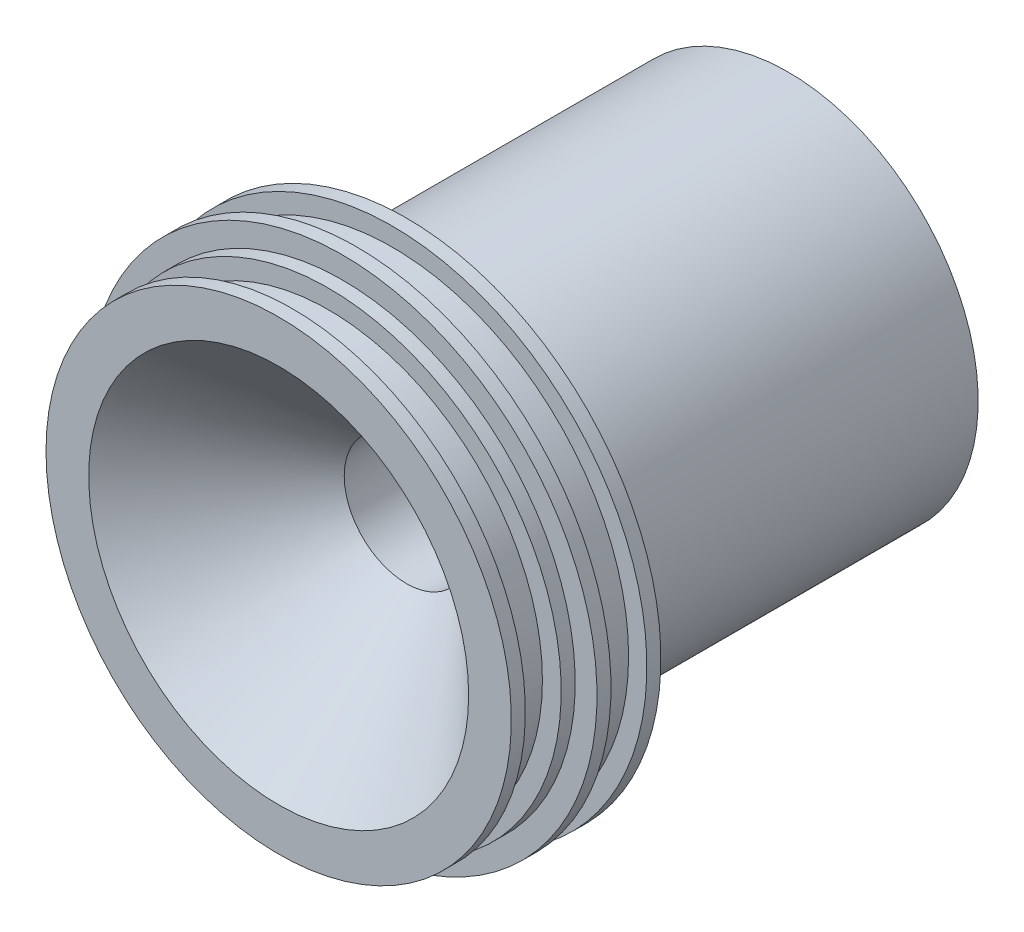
ISO-10303-21;
HEADER;
FILE_DESCRIPTION(('STEP AP214'),'2;1');
FILE_NAME('part.step','',(''),(''),'','','');
FILE_SCHEMA(('AUTOMOTIVE_DESIGN { 1 0 10303 214 1 1 1 1 }'));
ENDSEC;
DATA;
#1=APPLICATION_CONTEXT('core data for automotive mechanical design processes');
#2=APPLICATION_PROTOCOL_DEFINITION('international standard','automotive_design',2000,#1);
#3=PRODUCT_CONTEXT('',#1,'mechanical');
#4=PRODUCT('Part','Part','',(#3));
#5=PRODUCT_RELATED_PRODUCT_CATEGORY('part','',(#4));
#6=PRODUCT_DEFINITION_FORMATION('','',#4);
#7=PRODUCT_DEFINITION_CONTEXT('part definition',#1,'design');
#8=PRODUCT_DEFINITION('design','',#6,#7);
#9=PRODUCT_DEFINITION_SHAPE('','',#8);
#10=(LENGTH_UNIT() NAMED_UNIT(*) SI_UNIT(.MILLI.,.METRE.));
#11=(NAMED_UNIT(*) PLANE_ANGLE_UNIT() SI_UNIT($,.RADIAN.));
#12=(NAMED_UNIT(*) SI_UNIT($,.STERADIAN.) SOLID_ANGLE_UNIT());
#13=UNCERTAINTY_MEASURE_WITH_UNIT(LENGTH_MEASURE(1.E-05),#10,'distance_accuracy_value','');
#14=(GEOMETRIC_REPRESENTATION_CONTEXT(3) GLOBAL_UNCERTAINTY_ASSIGNED_CONTEXT((#13)) GLOBAL_UNIT_ASSIGNED_CONTEXT((#10,
#11,#12)) REPRESENTATION_CONTEXT('',''));
#15=CARTESIAN_POINT('',(0.,0.,0.));
#16=DIRECTION('',(0.,0.,1.));
#17=DIRECTION('',(1.,0.,0.));
#18=AXIS2_PLACEMENT_3D('',#15,#16,#17);
#19=CARTESIAN_POINT('',(0.,0.,-87.4649220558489));
#20=DIRECTION('',(0.,0.,-1.));
#21=DIRECTION('',(-1.,0.,0.));
#22=AXIS2_PLACEMENT_3D('',#19,#20,#21);
#23=CYLINDRICAL_SURFACE('',#22,37.846);
#24=CARTESIAN_POINT('',(0.,0.,16.7689530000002));
#25=DIRECTION('',(0.,0.,-1.));
#26=DIRECTION('',(-1.,0.,0.));
#27=AXIS2_PLACEMENT_3D('',#24,#25,#26);
#28=CIRCLE('',#27,37.846);
#29=CARTESIAN_POINT('',(-37.846,0.,16.7689530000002));
#30=VERTEX_POINT('',#29);
#31=EDGE_CURVE('E114',#30,#30,#28,.T.);
#32=ORIENTED_EDGE('',*,*,#31,.T.);
#33=EDGE_LOOP('',(#32));
#34=FACE_BOUND('',#33,.T.);
#35=CARTESIAN_POINT('',(0.,0.,14.6849465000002));
#36=DIRECTION('',(0.,0.,-1.));
#37=DIRECTION('',(-1.,0.,0.));
#38=AXIS2_PLACEMENT_3D('',#35,#36,#37);
#39=CIRCLE('',#38,37.846);
#40=CARTESIAN_POINT('',(-37.846,0.,14.6849465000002));
#41=VERTEX_POINT('',#40);
#42=EDGE_CURVE('E10',#41,#41,#39,.T.);
#43=ORIENTED_EDGE('',*,*,#42,.F.);
#44=EDGE_LOOP('',(#43));
#45=FACE_BOUND('',#44,.T.);
#46=ADVANCED_FACE('F37',(#34,#45),#23,.T.);
#47=CARTESIAN_POINT('',(0.,37.846,14.6849465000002));
#48=DIRECTION('',(0.,0.,-1.));
#49=DIRECTION('',(-1.,0.,0.));
#50=AXIS2_PLACEMENT_3D('',#47,#48,#49);
#51=PLANE('',#50);
#52=ORIENTED_EDGE('',*,*,#42,.T.);
#53=EDGE_LOOP('',(#52));
#54=FACE_BOUND('',#53,.T.);
#55=CARTESIAN_POINT('',(0.,0.,14.6849465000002));
#56=DIRECTION('',(0.,0.,-1.));
#57=DIRECTION('',(-1.,0.,0.));
#58=AXIS2_PLACEMENT_3D('',#55,#56,#57);
#59=CIRCLE('',#58,35.1282);
#60=CARTESIAN_POINT('',(-35.1282,0.,14.6849465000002));
#61=VERTEX_POINT('',#60);
#62=EDGE_CURVE('E44',#61,#61,#59,.T.);
#63=ORIENTED_EDGE('',*,*,#62,.F.);
#64=EDGE_LOOP('',(#63));
#65=FACE_BOUND('',#64,.T.);
#66=ADVANCED_FACE('F134',(#54,#65),#51,.T.);
#67=CARTESIAN_POINT('',(0.,0.,-87.4649220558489));
#68=DIRECTION('',(0.,0.,-1.));
#69=DIRECTION('',(-1.,0.,0.));
#70=AXIS2_PLACEMENT_3D('',#67,#68,#69);
#71=CYLINDRICAL_SURFACE('',#70,35.1282);
#72=ORIENTED_EDGE('',*,*,#62,.T.);
#73=EDGE_LOOP('',(#72));
#74=FACE_BOUND('',#73,.T.);
#75=CARTESIAN_POINT('',(0.,0.,9.35094650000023));
#76=DIRECTION('',(0.,0.,-1.));
#77=DIRECTION('',(-1.,0.,0.));
#78=AXIS2_PLACEMENT_3D('',#75,#76,#77);
#79=CIRCLE('',#78,35.1282);
#80=CARTESIAN_POINT('',(-35.1282,0.,9.35094650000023));
#81=VERTEX_POINT('',#80);
#82=EDGE_CURVE('E50',#81,#81,#79,.T.);
#83=ORIENTED_EDGE('',*,*,#82,.F.);
#84=EDGE_LOOP('',(#83));
#85=FACE_BOUND('',#84,.T.);
#86=ADVANCED_FACE('F138',(#74,#85),#71,.T.);
#87=CARTESIAN_POINT('',(0.,35.1282,9.35094650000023));
#88=DIRECTION('',(0.,0.,1.));
#89=DIRECTION('',(1.,0.,0.));
#90=AXIS2_PLACEMENT_3D('',#87,#88,#89);
#91=PLANE('',#90);
#92=ORIENTED_EDGE('',*,*,#82,.T.);
#93=EDGE_LOOP('',(#92));
#94=FACE_BOUND('',#93,.T.);
#95=CARTESIAN_POINT('',(0.,0.,9.35094650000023));
#96=DIRECTION('',(0.,0.,-1.));
#97=DIRECTION('',(-1.,0.,0.));
#98=AXIS2_PLACEMENT_3D('',#95,#96,#97);
#99=CIRCLE('',#98,37.846);
#100=CARTESIAN_POINT('',(-37.846,0.,9.35094650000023));
#101=VERTEX_POINT('',#100);
#102=EDGE_CURVE('E56',#101,#101,#99,.T.);
#103=ORIENTED_EDGE('',*,*,#102,.F.);
#104=EDGE_LOOP('',(#103));
#105=FACE_BOUND('',#104,.T.);
#106=ADVANCED_FACE('F142',(#94,#105),#91,.T.);
#107=CARTESIAN_POINT('',(0.,0.,-87.4649220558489));
#108=DIRECTION('',(0.,0.,-1.));
#109=DIRECTION('',(-1.,0.,0.));
#110=AXIS2_PLACEMENT_3D('',#107,#108,#109);
#111=CYLINDRICAL_SURFACE('',#110,37.846);
#112=ORIENTED_EDGE('',*,*,#102,.T.);
#113=EDGE_LOOP('',(#112));
#114=FACE_BOUND('',#113,.T.);
#115=CARTESIAN_POINT('',(0.,0.,7.26694000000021));
#116=DIRECTION('',(0.,0.,-1.));
#117=DIRECTION('',(-1.,0.,0.));
#118=AXIS2_PLACEMENT_3D('',#115,#116,#117);
#119=CIRCLE('',#118,37.846);
#120=CARTESIAN_POINT('',(-37.846,0.,7.26694000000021));
#121=VERTEX_POINT('',#120);
#122=EDGE_CURVE('E62',#121,#121,#119,.T.);
#123=ORIENTED_EDGE('',*,*,#122,.F.);
#124=EDGE_LOOP('',(#123));
#125=FACE_BOUND('',#124,.T.);
#126=ADVANCED_FACE('F148',(#114,#125),#111,.T.);
#127=CARTESIAN_POINT('',(0.,28.2575,7.26694000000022));
#128=DIRECTION('',(0.,0.,-1.));
#129=DIRECTION('',(-1.,0.,0.));
#130=AXIS2_PLACEMENT_3D('',#127,#128,#129);
#131=PLANE('',#130);
#132=ORIENTED_EDGE('',*,*,#122,.T.);
#133=EDGE_LOOP('',(#132));
#134=FACE_BOUND('',#133,.T.);
#135=CARTESIAN_POINT('',(0.,0.,7.26694000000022));
#136=DIRECTION('',(0.,0.,-1.));
#137=DIRECTION('',(-1.,0.,0.));
#138=AXIS2_PLACEMENT_3D('',#135,#136,#137);
#139=CIRCLE('',#138,28.2575);
#140=CARTESIAN_POINT('',(-28.2575,0.,7.26694000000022));
#141=VERTEX_POINT('',#140);
#142=EDGE_CURVE('E66',#141,#141,#139,.T.);
#143=ORIENTED_EDGE('',*,*,#142,.F.);
#144=EDGE_LOOP('',(#143));
#145=FACE_BOUND('',#144,.T.);
#146=ADVANCED_FACE('F152',(#134,#145),#131,.T.);
#147=CARTESIAN_POINT('',(0.,0.,-87.4649220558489));
#148=DIRECTION('',(0.,0.,-1.));
#149=DIRECTION('',(-1.,0.,0.));
#150=AXIS2_PLACEMENT_3D('',#147,#148,#149);
#151=CYLINDRICAL_SURFACE('',#150,28.2575);
#152=ORIENTED_EDGE('',*,*,#142,.T.);
#153=EDGE_LOOP('',(#152));
#154=FACE_BOUND('',#153,.T.);
#155=CARTESIAN_POINT('',(0.,0.,-49.5157182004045));
#156=DIRECTION('',(0.,0.,-1.));
#157=DIRECTION('',(-1.,0.,0.));
#158=AXIS2_PLACEMENT_3D('',#155,#156,#157);
#159=CIRCLE('',#158,28.2575);
#160=CARTESIAN_POINT('',(-28.2575,0.,-49.5157182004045));
#161=VERTEX_POINT('',#160);
#162=EDGE_CURVE('E70',#161,#161,#159,.T.);
#163=ORIENTED_EDGE('',*,*,#162,.F.);
#164=EDGE_LOOP('',(#163));
#165=FACE_BOUND('',#164,.T.);
#166=ADVANCED_FACE('F156',(#154,#165),#151,.T.);
#167=CARTESIAN_POINT('',(0.,20.574,-49.5157182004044));
#168=DIRECTION('',(0.,0.,-1.));
#169=DIRECTION('',(-1.,0.,0.));
#170=AXIS2_PLACEMENT_3D('',#167,#168,#169);
#171=PLANE('',#170);
#172=ORIENTED_EDGE('',*,*,#162,.T.);
#173=EDGE_LOOP('',(#172));
#174=FACE_BOUND('',#173,.T.);
#175=CARTESIAN_POINT('',(0.,0.,-49.5157182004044));
#176=DIRECTION('',(0.,0.,-1.));
#177=DIRECTION('',(-1.,0.,0.));
#178=AXIS2_PLACEMENT_3D('',#175,#176,#177);
#179=CIRCLE('',#178,20.574);
#180=CARTESIAN_POINT('',(-20.574,0.,-49.5157182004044));
#181=VERTEX_POINT('',#180);
#182=EDGE_CURVE('E74',#181,#181,#179,.T.);
#183=ORIENTED_EDGE('',*,*,#182,.F.);
#184=EDGE_LOOP('',(#183));
#185=FACE_BOUND('',#184,.T.);
#186=ADVANCED_FACE('F160',(#174,#185),#171,.T.);
#187=CARTESIAN_POINT('',(0.,0.,-7.26694));
#188=DIRECTION('',(0.,0.,-1.));
#189=DIRECTION('',(-1.,0.,0.));
#190=AXIS2_PLACEMENT_3D('',#187,#188,#189);
#191=CONICAL_SURFACE('',#190,9.25347399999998,0.26179938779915);
#192=ORIENTED_EDGE('',*,*,#182,.T.);
#193=EDGE_LOOP('',(#192));
#194=FACE_BOUND('',#193,.T.);
#195=CARTESIAN_POINT('',(0.,0.,-7.26694));
#196=DIRECTION('',(0.,0.,-1.));
#197=DIRECTION('',(-1.,0.,0.));
#198=AXIS2_PLACEMENT_3D('',#195,#196,#197);
#199=CIRCLE('',#198,9.25347399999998);
#200=CARTESIAN_POINT('',(-9.25347399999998,0.,-7.26694));
#201=VERTEX_POINT('',#200);
#202=EDGE_CURVE('E78',#201,#201,#199,.T.);
#203=ORIENTED_EDGE('',*,*,#202,.F.);
#204=EDGE_LOOP('',(#203));
#205=FACE_BOUND('',#204,.T.);
#206=ADVANCED_FACE('F164',(#194,#205),#191,.F.);
#207=CARTESIAN_POINT('',(0.,0.,-87.4649220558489));
#208=DIRECTION('',(0.,0.,-1.));
#209=DIRECTION('',(-1.,0.,0.));
#210=AXIS2_PLACEMENT_3D('',#207,#208,#209);
#211=CYLINDRICAL_SURFACE('',#210,9.25347399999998);
#212=ORIENTED_EDGE('',*,*,#202,.T.);
#213=EDGE_LOOP('',(#212));
#214=FACE_BOUND('',#213,.T.);
#215=CARTESIAN_POINT('',(0.,0.,7.26694));
#216=DIRECTION('',(0.,0.,-1.));
#217=DIRECTION('',(-1.,0.,0.));
#218=AXIS2_PLACEMENT_3D('',#215,#216,#217);
#219=CIRCLE('',#218,9.25347399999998);
#220=CARTESIAN_POINT('',(9.25347399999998,0.,7.26694));
#221=VERTEX_POINT('',#220);
#222=EDGE_CURVE('E82',#221,#221,#219,.T.);
#223=ORIENTED_EDGE('',*,*,#222,.F.);
#224=EDGE_LOOP('',(#223));
#225=FACE_BOUND('',#224,.T.);
#226=ADVANCED_FACE('F168',(#214,#225),#211,.F.);
#227=CARTESIAN_POINT('',(0.,0.,26.2709660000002));
#228=DIRECTION('',(0.,0.,1.));
#229=DIRECTION('',(1.,0.,0.));
#230=AXIS2_PLACEMENT_3D('',#227,#228,#229);
#231=CONICAL_SURFACE('',#230,28.2575,0.785398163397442);
#232=CARTESIAN_POINT('',(0.,0.,26.2709660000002));
#233=DIRECTION('',(0.,0.,-1.));
#234=DIRECTION('',(-1.,0.,0.));
#235=AXIS2_PLACEMENT_3D('',#232,#233,#234);
#236=CIRCLE('',#235,28.2575);
#237=CARTESIAN_POINT('',(28.2575,0.,26.2709660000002));
#238=VERTEX_POINT('',#237);
#239=EDGE_CURVE('E86',#238,#238,#236,.T.);
#240=CARTESIAN_POINT('',(9.25347399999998,0.,7.26694));
#241=CARTESIAN_POINT('',(9.45143260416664,0.,7.46489860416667));
#242=CARTESIAN_POINT('',(9.64939120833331,0.,7.66285720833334));
#243=CARTESIAN_POINT('',(10.0453084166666,0.,8.05877441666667));
#244=CARTESIAN_POINT('',(10.2432670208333,0.,8.25673302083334));
#245=CARTESIAN_POINT('',(10.6391842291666,0.,8.65265022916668));
#246=CARTESIAN_POINT('',(10.8371428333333,0.,8.85060883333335));
#247=CARTESIAN_POINT('',(11.2330600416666,0.,9.24652604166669));
#248=CARTESIAN_POINT('',(11.4310186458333,0.,9.44448464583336));
#249=CARTESIAN_POINT('',(11.8269358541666,0.,9.8404018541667));
#250=CARTESIAN_POINT('',(12.0248944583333,0.,10.0383604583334));
#251=CARTESIAN_POINT('',(12.4208116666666,0.,10.4342776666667));
#252=CARTESIAN_POINT('',(12.6187702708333,0.,10.6322362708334));
#253=CARTESIAN_POINT('',(13.0146874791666,0.,11.0281534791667));
#254=CARTESIAN_POINT('',(13.2126460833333,0.,11.2261120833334));
#255=CARTESIAN_POINT('',(13.6085632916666,0.,11.6220292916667));
#256=CARTESIAN_POINT('',(13.8065218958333,0.,11.8199878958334));
#257=CARTESIAN_POINT('',(14.2024391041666,0.,12.2159051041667));
#258=CARTESIAN_POINT('',(14.4003977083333,0.,12.4138637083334));
#259=CARTESIAN_POINT('',(14.7963149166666,0.,12.8097809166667));
#260=CARTESIAN_POINT('',(14.9942735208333,0.,13.0077395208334));
#261=CARTESIAN_POINT('',(15.3901907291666,0.,13.4036567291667));
#262=CARTESIAN_POINT('',(15.5881493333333,0.,13.6016153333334));
#263=CARTESIAN_POINT('',(15.9840665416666,0.,13.9975325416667));
#264=CARTESIAN_POINT('',(16.1820251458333,0.,14.1954911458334));
#265=CARTESIAN_POINT('',(16.5779423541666,0.,14.5914083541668));
#266=CARTESIAN_POINT('',(16.7759009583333,0.,14.7893669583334));
#267=CARTESIAN_POINT('',(17.1718181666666,0.,15.1852841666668));
#268=CARTESIAN_POINT('',(17.3697767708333,0.,15.3832427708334));
#269=CARTESIAN_POINT('',(17.7656939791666,0.,15.7791599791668));
#270=CARTESIAN_POINT('',(17.9636525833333,0.,15.9771185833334));
#271=CARTESIAN_POINT('',(18.3595697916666,0.,16.3730357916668));
#272=CARTESIAN_POINT('',(18.5575283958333,0.,16.5709943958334));
#273=CARTESIAN_POINT('',(18.9534456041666,0.,16.9669116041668));
#274=CARTESIAN_POINT('',(19.1514042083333,0.,17.1648702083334));
#275=CARTESIAN_POINT('',(19.5473214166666,0.,17.5607874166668));
#276=CARTESIAN_POINT('',(19.7452800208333,0.,17.7587460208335));
#277=CARTESIAN_POINT('',(20.1411972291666,0.,18.1546632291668));
#278=CARTESIAN_POINT('',(20.3391558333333,0.,18.3526218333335));
#279=CARTESIAN_POINT('',(20.7350730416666,0.,18.7485390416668));
#280=CARTESIAN_POINT('',(20.9330316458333,0.,18.9464976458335));
#281=CARTESIAN_POINT('',(21.3289488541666,0.,19.3424148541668));
#282=CARTESIAN_POINT('',(21.5269074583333,0.,19.5403734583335));
#283=CARTESIAN_POINT('',(21.9228246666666,0.,19.9362906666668));
#284=CARTESIAN_POINT('',(22.1207832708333,0.,20.1342492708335));
#285=CARTESIAN_POINT('',(22.5167004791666,0.,20.5301664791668));
#286=CARTESIAN_POINT('',(22.7146590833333,0.,20.7281250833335));
#287=CARTESIAN_POINT('',(23.1105762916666,0.,21.1240422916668));
#288=CARTESIAN_POINT('',(23.3085348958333,0.,21.3220008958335));
#289=CARTESIAN_POINT('',(23.7044521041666,0.,21.7179181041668));
#290=CARTESIAN_POINT('',(23.9024107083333,0.,21.9158767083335));
#291=CARTESIAN_POINT('',(24.2983279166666,0.,22.3117939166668));
#292=CARTESIAN_POINT('',(24.4962865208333,0.,22.5097525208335));
#293=CARTESIAN_POINT('',(24.8922037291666,0.,22.9056697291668));
#294=CARTESIAN_POINT('',(25.0901623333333,0.,23.1036283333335));
#295=CARTESIAN_POINT('',(25.4860795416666,0.,23.4995455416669));
#296=CARTESIAN_POINT('',(25.6840381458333,0.,23.6975041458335));
#297=CARTESIAN_POINT('',(26.0799553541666,0.,24.0934213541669));
#298=CARTESIAN_POINT('',(26.2779139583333,0.,24.2913799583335));
#299=CARTESIAN_POINT('',(26.6738311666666,0.,24.6872971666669));
#300=CARTESIAN_POINT('',(26.8717897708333,0.,24.8852557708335));
#301=CARTESIAN_POINT('',(27.2677069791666,0.,25.2811729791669));
#302=CARTESIAN_POINT('',(27.4656655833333,0.,25.4791315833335));
#303=CARTESIAN_POINT('',(27.8615827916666,0.,25.8750487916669));
#304=CARTESIAN_POINT('',(28.0595413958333,0.,26.0730073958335));
#305=CARTESIAN_POINT('',(28.2575,0.,26.2709660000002));
#306=B_SPLINE_CURVE_WITH_KNOTS('',3,(#240,#241,#242,#243,#244,#245,#246,#247,#248,#249,#250,
#251,#252,#253,#254,#255,#256,#257,#258,#259,#260,#261,#262,#263,#264,#265,#266,#267,#268,#269,
#270,#271,#272,#273,#274,#275,#276,#277,#278,#279,#280,#281,#282,#283,#284,#285,#286,#287,#288,
#289,#290,#291,#292,#293,#294,#295,#296,#297,#298,#299,#300,#301,#302,#303,#304,#305),
.UNSPECIFIED.,.F.,.F.,(4,2,2,2,2,2,2,2,2,2,2,2,2,2,2,2,2,2,2,2,2,2,2,2,2,2,2,2,2,2,2,2,4),(0.,
0.839867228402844,1.67973445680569,2.51960168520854,3.35946891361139,4.19933614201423,
5.03920337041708,5.87907059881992,6.71893782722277,7.55880505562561,8.39867228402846,
9.2385395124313,10.0784067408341,10.918273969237,11.7581411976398,12.5980084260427,
13.4378756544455,14.2777428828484,15.1176101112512,15.9574773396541,16.7973445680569,
17.6372117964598,18.4770790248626,19.3169462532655,20.1568134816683,20.9966807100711,
21.836547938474,22.6764151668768,23.5162823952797,24.3561496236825,25.1960168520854,
26.0358840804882,26.8757513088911),.UNSPECIFIED.);
#307=EDGE_CURVE('BSEAM172',#221,#238,#306,.T.);
#308=ORIENTED_EDGE('',*,*,#222,.T.);
#309=ORIENTED_EDGE('',*,*,#239,.F.);
#310=ORIENTED_EDGE('',*,*,#307,.T.);
#311=ORIENTED_EDGE('',*,*,#307,.F.);
#312=EDGE_LOOP('',(#308,#310,#309,#311));
#313=FACE_BOUND('',#312,.T.);
#314=ADVANCED_FACE('F172',(#313),#231,.F.);
#315=CARTESIAN_POINT('',(0.,34.6075,26.2709660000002));
#316=DIRECTION('',(0.,0.,1.));
#317=DIRECTION('',(1.,0.,0.));
#318=AXIS2_PLACEMENT_3D('',#315,#316,#317);
#319=PLANE('',#318);
#320=ORIENTED_EDGE('',*,*,#239,.T.);
#321=EDGE_LOOP('',(#320));
#322=FACE_BOUND('',#321,.T.);
#323=CARTESIAN_POINT('',(0.,0.,26.2709660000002));
#324=DIRECTION('',(0.,0.,-1.));
#325=DIRECTION('',(-1.,0.,0.));
#326=AXIS2_PLACEMENT_3D('',#323,#324,#325);
#327=CIRCLE('',#326,34.6075);
#328=CARTESIAN_POINT('',(-34.6075,0.,26.2709660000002));
#329=VERTEX_POINT('',#328);
#330=EDGE_CURVE('E90',#329,#329,#327,.T.);
#331=ORIENTED_EDGE('',*,*,#330,.F.);
#332=EDGE_LOOP('',(#331));
#333=FACE_BOUND('',#332,.T.);
#334=ADVANCED_FACE('F176',(#322,#333),#319,.T.);
#335=CARTESIAN_POINT('',(0.,0.,-87.4649220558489));
#336=DIRECTION('',(0.,0.,-1.));
#337=DIRECTION('',(-1.,0.,0.));
#338=AXIS2_PLACEMENT_3D('',#335,#336,#337);
#339=CYLINDRICAL_SURFACE('',#338,34.6075);
#340=ORIENTED_EDGE('',*,*,#330,.T.);
#341=EDGE_LOOP('',(#340));
#342=FACE_BOUND('',#341,.T.);
#343=CARTESIAN_POINT('',(0.,0.,24.1869595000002));
#344=DIRECTION('',(0.,0.,-1.));
#345=DIRECTION('',(-1.,0.,0.));
#346=AXIS2_PLACEMENT_3D('',#343,#344,#345);
#347=CIRCLE('',#346,34.6075);
#348=CARTESIAN_POINT('',(-34.6075,0.,24.1869595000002));
#349=VERTEX_POINT('',#348);
#350=EDGE_CURVE('E94',#349,#349,#347,.T.);
#351=ORIENTED_EDGE('',*,*,#350,.F.);
#352=EDGE_LOOP('',(#351));
#353=FACE_BOUND('',#352,.T.);
#354=ADVANCED_FACE('F180',(#342,#353),#339,.T.);
#355=CARTESIAN_POINT('',(0.,34.6075,24.1869595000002));
#356=DIRECTION('',(0.,0.,-1.));
#357=DIRECTION('',(-1.,0.,0.));
#358=AXIS2_PLACEMENT_3D('',#355,#356,#357);
#359=PLANE('',#358);
#360=ORIENTED_EDGE('',*,*,#350,.T.);
#361=EDGE_LOOP('',(#360));
#362=FACE_BOUND('',#361,.T.);
#363=CARTESIAN_POINT('',(0.,0.,24.1869595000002));
#364=DIRECTION('',(0.,0.,-1.));
#365=DIRECTION('',(-1.,0.,0.));
#366=AXIS2_PLACEMENT_3D('',#363,#364,#365);
#367=CIRCLE('',#366,31.8135);
#368=CARTESIAN_POINT('',(-31.8135,0.,24.1869595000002));
#369=VERTEX_POINT('',#368);
#370=EDGE_CURVE('E98',#369,#369,#367,.T.);
#371=ORIENTED_EDGE('',*,*,#370,.F.);
#372=EDGE_LOOP('',(#371));
#373=FACE_BOUND('',#372,.T.);
#374=ADVANCED_FACE('F184',(#362,#373),#359,.T.);
#375=CARTESIAN_POINT('',(0.,0.,-87.4649220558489));
#376=DIRECTION('',(0.,0.,-1.));
#377=DIRECTION('',(-1.,0.,0.));
#378=AXIS2_PLACEMENT_3D('',#375,#376,#377);
#379=CYLINDRICAL_SURFACE('',#378,31.8135);
#380=ORIENTED_EDGE('',*,*,#370,.T.);
#381=EDGE_LOOP('',(#380));
#382=FACE_BOUND('',#381,.T.);
#383=CARTESIAN_POINT('',(0.,0.,18.8529595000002));
#384=DIRECTION('',(0.,0.,-1.));
#385=DIRECTION('',(-1.,0.,0.));
#386=AXIS2_PLACEMENT_3D('',#383,#384,#385);
#387=CIRCLE('',#386,31.8135);
#388=CARTESIAN_POINT('',(-31.8135,0.,18.8529595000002));
#389=VERTEX_POINT('',#388);
#390=EDGE_CURVE('E102',#389,#389,#387,.T.);
#391=ORIENTED_EDGE('',*,*,#390,.F.);
#392=EDGE_LOOP('',(#391));
#393=FACE_BOUND('',#392,.T.);
#394=ADVANCED_FACE('F188',(#382,#393),#379,.T.);
#395=CARTESIAN_POINT('',(0.,31.8135,18.8529595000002));
#396=DIRECTION('',(0.,0.,1.));
#397=DIRECTION('',(1.,0.,0.));
#398=AXIS2_PLACEMENT_3D('',#395,#396,#397);
#399=PLANE('',#398);
#400=ORIENTED_EDGE('',*,*,#390,.T.);
#401=EDGE_LOOP('',(#400));
#402=FACE_BOUND('',#401,.T.);
#403=CARTESIAN_POINT('',(0.,0.,18.8529595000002));
#404=DIRECTION('',(0.,0.,-1.));
#405=DIRECTION('',(-1.,0.,0.));
#406=AXIS2_PLACEMENT_3D('',#403,#404,#405);
#407=CIRCLE('',#406,34.6075);
#408=CARTESIAN_POINT('',(-34.6075,0.,18.8529595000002));
#409=VERTEX_POINT('',#408);
#410=EDGE_CURVE('E106',#409,#409,#407,.T.);
#411=ORIENTED_EDGE('',*,*,#410,.F.);
#412=EDGE_LOOP('',(#411));
#413=FACE_BOUND('',#412,.T.);
#414=ADVANCED_FACE('F130',(#402,#413),#399,.T.);
#415=CARTESIAN_POINT('',(0.,0.,-87.4649220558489));
#416=DIRECTION('',(0.,0.,-1.));
#417=DIRECTION('',(-1.,0.,0.));
#418=AXIS2_PLACEMENT_3D('',#415,#416,#417);
#419=CYLINDRICAL_SURFACE('',#418,34.6075);
#420=ORIENTED_EDGE('',*,*,#410,.T.);
#421=EDGE_LOOP('',(#420));
#422=FACE_BOUND('',#421,.T.);
#423=CARTESIAN_POINT('',(0.,0.,16.7689530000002));
#424=DIRECTION('',(0.,0.,-1.));
#425=DIRECTION('',(-1.,0.,0.));
#426=AXIS2_PLACEMENT_3D('',#423,#424,#425);
#427=CIRCLE('',#426,34.6075);
#428=CARTESIAN_POINT('',(-34.6075,0.,16.7689530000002));
#429=VERTEX_POINT('',#428);
#430=EDGE_CURVE('E110',#429,#429,#427,.T.);
#431=ORIENTED_EDGE('',*,*,#430,.F.);
#432=EDGE_LOOP('',(#431));
#433=FACE_BOUND('',#432,.T.);
#434=ADVANCED_FACE('F124',(#422,#433),#419,.T.);
#435=CARTESIAN_POINT('',(0.,37.846,16.7689530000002));
#436=DIRECTION('',(0.,0.,1.));
#437=DIRECTION('',(1.,0.,0.));
#438=AXIS2_PLACEMENT_3D('',#435,#436,#437);
#439=PLANE('',#438);
#440=ORIENTED_EDGE('',*,*,#430,.T.);
#441=EDGE_LOOP('',(#440));
#442=FACE_BOUND('',#441,.T.);
#443=ORIENTED_EDGE('',*,*,#31,.F.);
#444=EDGE_LOOP('',(#443));
#445=FACE_BOUND('',#444,.T.);
#446=ADVANCED_FACE('F122',(#442,#445),#439,.T.);
#447=CLOSED_SHELL('',(#46,#66,#86,#106,#126,#146,#166,#186,#206,#226,#314,#334,#354,#374,#394,
#414,#434,#446));
#448=MANIFOLD_SOLID_BREP('B2',#447);
#449=ADVANCED_BREP_SHAPE_REPRESENTATION('',(#18,#448),#14);
#450=SHAPE_DEFINITION_REPRESENTATION(#9,#449);
ENDSEC;
END-ISO-10303-21;
